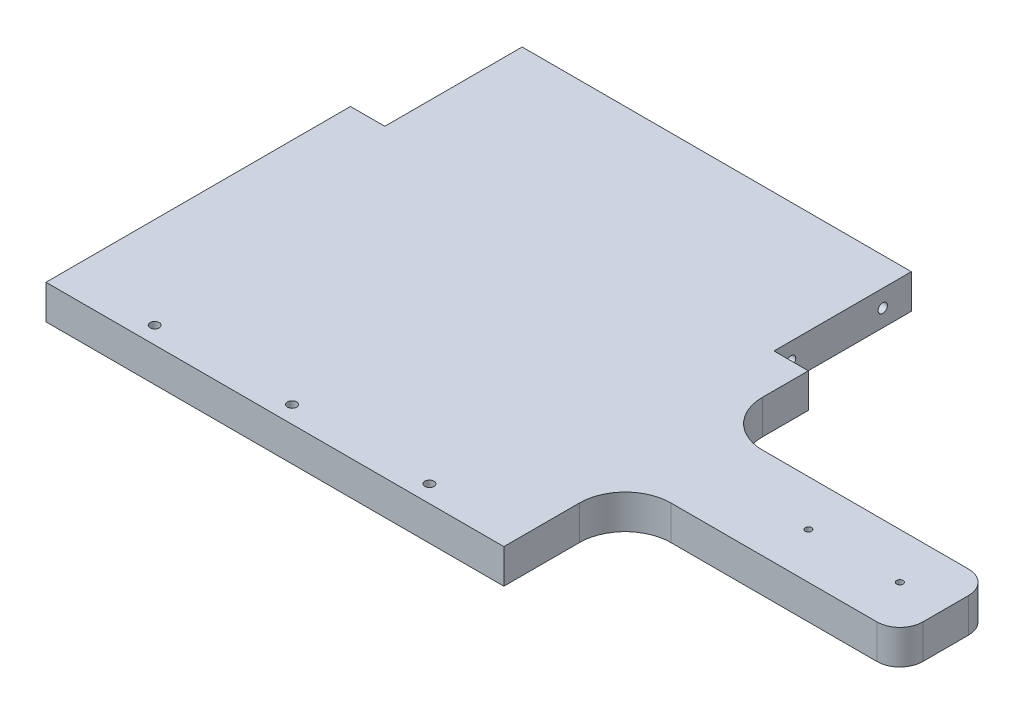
ISO-10303-21;
HEADER;
FILE_DESCRIPTION(('STEP AP214'),'2;1');
FILE_NAME('part.step','',(''),(''),'','','');
FILE_SCHEMA(('AUTOMOTIVE_DESIGN { 1 0 10303 214 1 1 1 1 }'));
ENDSEC;
DATA;
#1=APPLICATION_CONTEXT('core data for automotive mechanical design processes');
#2=APPLICATION_PROTOCOL_DEFINITION('international standard','automotive_design',2000,#1);
#3=PRODUCT_CONTEXT('',#1,'mechanical');
#4=PRODUCT('Part','Part','',(#3));
#5=PRODUCT_RELATED_PRODUCT_CATEGORY('part','',(#4));
#6=PRODUCT_DEFINITION_FORMATION('','',#4);
#7=PRODUCT_DEFINITION_CONTEXT('part definition',#1,'design');
#8=PRODUCT_DEFINITION('design','',#6,#7);
#9=PRODUCT_DEFINITION_SHAPE('','',#8);
#10=(LENGTH_UNIT() NAMED_UNIT(*) SI_UNIT(.MILLI.,.METRE.));
#11=(NAMED_UNIT(*) PLANE_ANGLE_UNIT() SI_UNIT($,.RADIAN.));
#12=(NAMED_UNIT(*) SI_UNIT($,.STERADIAN.) SOLID_ANGLE_UNIT());
#13=UNCERTAINTY_MEASURE_WITH_UNIT(LENGTH_MEASURE(1.E-05),#10,'distance_accuracy_value','');
#14=(GEOMETRIC_REPRESENTATION_CONTEXT(3) GLOBAL_UNCERTAINTY_ASSIGNED_CONTEXT((#13)) GLOBAL_UNIT_ASSIGNED_CONTEXT((#10,
#11,#12)) REPRESENTATION_CONTEXT('',''));
#15=CARTESIAN_POINT('',(0.,0.,0.));
#16=DIRECTION('',(0.,0.,1.));
#17=DIRECTION('',(1.,0.,0.));
#18=AXIS2_PLACEMENT_3D('',#15,#16,#17);
#19=CARTESIAN_POINT('',(107.95,9.525,-106.68));
#20=DIRECTION('',(1.,0.,0.));
#21=DIRECTION('',(0.,0.,-1.));
#22=AXIS2_PLACEMENT_3D('',#19,#20,#21);
#23=CYLINDRICAL_SURFACE('',#22,2.55269999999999);
#24=CARTESIAN_POINT('',(107.95,9.525,-106.68));
#25=DIRECTION('',(1.,0.,0.));
#26=DIRECTION('',(0.,0.,-1.));
#27=AXIS2_PLACEMENT_3D('',#24,#25,#26);
#28=CIRCLE('',#27,2.5527);
#29=CARTESIAN_POINT('',(107.95,9.525,-109.2327));
#30=VERTEX_POINT('',#29);
#31=EDGE_CURVE('E218',#30,#30,#28,.T.);
#32=ORIENTED_EDGE('',*,*,#31,.T.);
#33=EDGE_LOOP('',(#32));
#34=FACE_BOUND('',#33,.T.);
#35=CARTESIAN_POINT('',(63.5,9.525,-106.68));
#36=DIRECTION('',(0.707106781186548,0.,0.707106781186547));
#37=DIRECTION('',(0.707106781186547,0.,-0.707106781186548));
#38=AXIS2_PLACEMENT_3D('',#35,#36,#37);
#39=ELLIPSE('',#38,3.61006296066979,2.55269999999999);
#40=CARTESIAN_POINT('',(63.5,12.0777,-106.68));
#41=VERTEX_POINT('',#40);
#42=CARTESIAN_POINT('',(63.5,6.97230000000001,-106.68));
#43=VERTEX_POINT('',#42);
#44=EDGE_CURVE('E47',#41,#43,#39,.F.);
#45=ORIENTED_EDGE('',*,*,#44,.T.);
#46=CARTESIAN_POINT('',(63.5,9.525,-106.68));
#47=DIRECTION('',(0.707106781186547,0.,-0.707106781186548));
#48=DIRECTION('',(0.707106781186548,0.,0.707106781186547));
#49=AXIS2_PLACEMENT_3D('',#46,#47,#48);
#50=ELLIPSE('',#49,3.61006296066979,2.55269999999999);
#51=EDGE_CURVE('E11',#43,#41,#50,.F.);
#52=ORIENTED_EDGE('',*,*,#51,.T.);
#53=EDGE_LOOP('',(#45,#52));
#54=FACE_BOUND('',#53,.T.);
#55=ADVANCED_FACE('F34',(#34,#54),#23,.F.);
#56=CARTESIAN_POINT('',(-107.95,9.525,-106.68));
#57=DIRECTION('',(-1.,0.,0.));
#58=DIRECTION('',(0.,0.,1.));
#59=AXIS2_PLACEMENT_3D('',#56,#57,#58);
#60=CYLINDRICAL_SURFACE('',#59,2.55269999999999);
#61=CARTESIAN_POINT('',(-107.95,9.525,-106.68));
#62=DIRECTION('',(-1.,0.,0.));
#63=DIRECTION('',(0.,0.,1.));
#64=AXIS2_PLACEMENT_3D('',#61,#62,#63);
#65=CIRCLE('',#64,2.5527);
#66=CARTESIAN_POINT('',(-107.95,9.525,-104.1273));
#67=VERTEX_POINT('',#66);
#68=EDGE_CURVE('E206',#67,#67,#65,.T.);
#69=ORIENTED_EDGE('',*,*,#68,.T.);
#70=EDGE_LOOP('',(#69));
#71=FACE_BOUND('',#70,.T.);
#72=CARTESIAN_POINT('',(-63.5,9.525,-106.68));
#73=DIRECTION('',(-0.707106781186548,0.,0.707106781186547));
#74=DIRECTION('',(-0.707106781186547,0.,-0.707106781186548));
#75=AXIS2_PLACEMENT_3D('',#72,#73,#74);
#76=ELLIPSE('',#75,3.61006296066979,2.55269999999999);
#77=CARTESIAN_POINT('',(-63.5,6.97230000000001,-106.68));
#78=VERTEX_POINT('',#77);
#79=CARTESIAN_POINT('',(-63.5,12.0777,-106.68));
#80=VERTEX_POINT('',#79);
#81=EDGE_CURVE('E54',#78,#80,#76,.F.);
#82=ORIENTED_EDGE('',*,*,#81,.T.);
#83=CARTESIAN_POINT('',(-63.5,9.525,-106.68));
#84=DIRECTION('',(-0.707106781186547,0.,-0.707106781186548));
#85=DIRECTION('',(-0.707106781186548,0.,0.707106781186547));
#86=AXIS2_PLACEMENT_3D('',#83,#84,#85);
#87=ELLIPSE('',#86,3.61006296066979,2.55269999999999);
#88=EDGE_CURVE('E384',#80,#78,#87,.F.);
#89=ORIENTED_EDGE('',*,*,#88,.T.);
#90=EDGE_LOOP('',(#82,#89));
#91=FACE_BOUND('',#90,.T.);
#92=ADVANCED_FACE('F399',(#71,#91),#60,.F.);
#93=CARTESIAN_POINT('',(0.,19.05,-122.555));
#94=DIRECTION('',(0.,0.,1.));
#95=DIRECTION('',(1.,0.,0.));
#96=AXIS2_PLACEMENT_3D('',#93,#94,#95);
#97=PLANE('',#96);
#98=CARTESIAN_POINT('',(0.,9.52500000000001,-122.555));
#99=DIRECTION('',(0.,0.,-1.));
#100=DIRECTION('',(-1.,0.,0.));
#101=AXIS2_PLACEMENT_3D('',#98,#99,#100);
#102=CIRCLE('',#101,2.5527);
#103=CARTESIAN_POINT('',(-2.55270000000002,9.52500000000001,-122.555));
#104=VERTEX_POINT('',#103);
#105=EDGE_CURVE('E190',#104,#104,#102,.T.);
#106=ORIENTED_EDGE('',*,*,#105,.F.);
#107=EDGE_LOOP('',(#106));
#108=FACE_BOUND('',#107,.T.);
#109=CARTESIAN_POINT('',(63.5,9.525,-122.555));
#110=DIRECTION('',(0.,0.,-1.));
#111=DIRECTION('',(-1.,0.,0.));
#112=AXIS2_PLACEMENT_3D('',#109,#110,#111);
#113=CIRCLE('',#112,2.55269999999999);
#114=CARTESIAN_POINT('',(60.9473,9.525,-122.555));
#115=VERTEX_POINT('',#114);
#116=EDGE_CURVE('E189',#115,#115,#113,.T.);
#117=ORIENTED_EDGE('',*,*,#116,.F.);
#118=EDGE_LOOP('',(#117));
#119=FACE_BOUND('',#118,.T.);
#120=CARTESIAN_POINT('',(-63.5,9.525,-122.555));
#121=DIRECTION('',(0.,0.,-1.));
#122=DIRECTION('',(-1.,0.,0.));
#123=AXIS2_PLACEMENT_3D('',#120,#121,#122);
#124=CIRCLE('',#123,2.5527);
#125=CARTESIAN_POINT('',(-66.0527,9.525,-122.555));
#126=VERTEX_POINT('',#125);
#127=EDGE_CURVE('E200',#126,#126,#124,.T.);
#128=ORIENTED_EDGE('',*,*,#127,.F.);
#129=EDGE_LOOP('',(#128));
#130=FACE_BOUND('',#129,.T.);
#131=DIRECTION('',(0.,1.,0.));
#132=VECTOR('',#131,1.);
#133=CARTESIAN_POINT('',(107.95,19.05,-122.555));
#134=LINE('',#133,#132);
#135=CARTESIAN_POINT('',(107.95,0.,-122.555));
#136=VERTEX_POINT('',#135);
#137=CARTESIAN_POINT('',(107.95,19.05,-122.555));
#138=VERTEX_POINT('',#137);
#139=EDGE_CURVE('E238',#136,#138,#134,.T.);
#140=ORIENTED_EDGE('',*,*,#139,.F.);
#141=DIRECTION('',(-1.,0.,0.));
#142=VECTOR('',#141,1.);
#143=CARTESIAN_POINT('',(0.,0.,-122.555));
#144=LINE('',#143,#142);
#145=CARTESIAN_POINT('',(-107.95,0.,-122.555));
#146=VERTEX_POINT('',#145);
#147=EDGE_CURVE('E331',#136,#146,#144,.T.);
#148=ORIENTED_EDGE('',*,*,#147,.T.);
#149=DIRECTION('',(0.,-1.,0.));
#150=VECTOR('',#149,1.);
#151=CARTESIAN_POINT('',(-107.95,0.,-122.555));
#152=LINE('',#151,#150);
#153=CARTESIAN_POINT('',(-107.95,19.05,-122.555));
#154=VERTEX_POINT('',#153);
#155=EDGE_CURVE('E274',#154,#146,#152,.T.);
#156=ORIENTED_EDGE('',*,*,#155,.F.);
#157=DIRECTION('',(-1.,0.,0.));
#158=VECTOR('',#157,1.);
#159=CARTESIAN_POINT('',(0.,19.05,-122.555));
#160=LINE('',#159,#158);
#161=EDGE_CURVE('E310',#138,#154,#160,.T.);
#162=ORIENTED_EDGE('',*,*,#161,.F.);
#163=EDGE_LOOP('',(#140,#148,#156,#162));
#164=FACE_BOUND('',#163,.T.);
#165=ADVANCED_FACE('F405',(#108,#119,#130,#164),#97,.F.);
#166=CARTESIAN_POINT('',(127.,19.05,0.));
#167=DIRECTION('',(-1.,0.,0.));
#168=DIRECTION('',(0.,0.,1.));
#169=AXIS2_PLACEMENT_3D('',#166,#167,#168);
#170=PLANE('',#169);
#171=DIRECTION('',(0.,0.,-1.));
#172=VECTOR('',#171,1.);
#173=CARTESIAN_POINT('',(127.,0.,0.));
#174=LINE('',#173,#172);
#175=CARTESIAN_POINT('',(127.,0.,122.555));
#176=VERTEX_POINT('',#175);
#177=CARTESIAN_POINT('',(127.,0.,80.645));
#178=VERTEX_POINT('',#177);
#179=EDGE_CURVE('E293',#176,#178,#174,.T.);
#180=ORIENTED_EDGE('',*,*,#179,.T.);
#181=DIRECTION('',(0.,-1.,0.));
#182=VECTOR('',#181,1.);
#183=CARTESIAN_POINT('',(127.,19.05,80.645));
#184=LINE('',#183,#182);
#185=CARTESIAN_POINT('',(127.,19.05,80.645));
#186=VERTEX_POINT('',#185);
#187=EDGE_CURVE('E353',#178,#186,#184,.F.);
#188=ORIENTED_EDGE('',*,*,#187,.T.);
#189=DIRECTION('',(0.,0.,-1.));
#190=VECTOR('',#189,1.);
#191=CARTESIAN_POINT('',(127.,19.05,0.));
#192=LINE('',#191,#190);
#193=CARTESIAN_POINT('',(127.,19.05,122.555));
#194=VERTEX_POINT('',#193);
#195=EDGE_CURVE('E296',#194,#186,#192,.T.);
#196=ORIENTED_EDGE('',*,*,#195,.F.);
#197=DIRECTION('',(0.,-1.,0.));
#198=VECTOR('',#197,1.);
#199=CARTESIAN_POINT('',(127.,19.05,122.555));
#200=LINE('',#199,#198);
#201=EDGE_CURVE('E318',#194,#176,#200,.T.);
#202=ORIENTED_EDGE('',*,*,#201,.T.);
#203=EDGE_LOOP('',(#180,#188,#196,#202));
#204=FACE_BOUND('',#203,.T.);
#205=ADVANCED_FACE('F492',(#204),#170,.F.);
#206=CARTESIAN_POINT('',(0.,19.05,55.245));
#207=DIRECTION('',(0.,0.,-1.));
#208=DIRECTION('',(-1.,0.,0.));
#209=AXIS2_PLACEMENT_3D('',#206,#207,#208);
#210=PLANE('',#209);
#211=DIRECTION('',(1.,0.,0.));
#212=VECTOR('',#211,1.);
#213=CARTESIAN_POINT('',(0.,0.,55.245));
#214=LINE('',#213,#212);
#215=CARTESIAN_POINT('',(152.4,0.,55.245));
#216=VERTEX_POINT('',#215);
#217=CARTESIAN_POINT('',(266.7,0.,55.245));
#218=VERTEX_POINT('',#217);
#219=EDGE_CURVE('E321',#216,#218,#214,.T.);
#220=ORIENTED_EDGE('',*,*,#219,.T.);
#221=DIRECTION('',(0.,-1.,0.));
#222=VECTOR('',#221,1.);
#223=CARTESIAN_POINT('',(266.7,19.05,55.245));
#224=LINE('',#223,#222);
#225=CARTESIAN_POINT('',(266.7,19.05,55.245));
#226=VERTEX_POINT('',#225);
#227=EDGE_CURVE('E373',#218,#226,#224,.F.);
#228=ORIENTED_EDGE('',*,*,#227,.T.);
#229=DIRECTION('',(1.,0.,0.));
#230=VECTOR('',#229,1.);
#231=CARTESIAN_POINT('',(0.,19.05,55.245));
#232=LINE('',#231,#230);
#233=CARTESIAN_POINT('',(152.4,19.05,55.245));
#234=VERTEX_POINT('',#233);
#235=EDGE_CURVE('E299',#234,#226,#232,.T.);
#236=ORIENTED_EDGE('',*,*,#235,.F.);
#237=DIRECTION('',(0.,-1.,0.));
#238=VECTOR('',#237,1.);
#239=CARTESIAN_POINT('',(152.4,0.,55.245));
#240=LINE('',#239,#238);
#241=EDGE_CURVE('E350',#234,#216,#240,.T.);
#242=ORIENTED_EDGE('',*,*,#241,.T.);
#243=EDGE_LOOP('',(#220,#228,#236,#242));
#244=FACE_BOUND('',#243,.T.);
#245=ADVANCED_FACE('F504',(#244),#210,.F.);
#246=CARTESIAN_POINT('',(279.4,19.05,0.));
#247=DIRECTION('',(1.,0.,0.));
#248=DIRECTION('',(0.,0.,-1.));
#249=AXIS2_PLACEMENT_3D('',#246,#247,#248);
#250=PLANE('',#249);
#251=DIRECTION('',(0.,0.,1.));
#252=VECTOR('',#251,1.);
#253=CARTESIAN_POINT('',(279.4,19.05,0.));
#254=LINE('',#253,#252);
#255=CARTESIAN_POINT('',(279.4,19.05,17.145));
#256=VERTEX_POINT('',#255);
#257=CARTESIAN_POINT('',(279.4,19.05,42.545));
#258=VERTEX_POINT('',#257);
#259=EDGE_CURVE('E304',#256,#258,#254,.T.);
#260=ORIENTED_EDGE('',*,*,#259,.T.);
#261=DIRECTION('',(0.,-1.,0.));
#262=VECTOR('',#261,1.);
#263=CARTESIAN_POINT('',(279.4,0.,42.545));
#264=LINE('',#263,#262);
#265=CARTESIAN_POINT('',(279.4,0.,42.545));
#266=VERTEX_POINT('',#265);
#267=EDGE_CURVE('E368',#258,#266,#264,.T.);
#268=ORIENTED_EDGE('',*,*,#267,.T.);
#269=DIRECTION('',(0.,0.,1.));
#270=VECTOR('',#269,1.);
#271=CARTESIAN_POINT('',(279.4,0.,0.));
#272=LINE('',#271,#270);
#273=CARTESIAN_POINT('',(279.4,0.,17.145));
#274=VERTEX_POINT('',#273);
#275=EDGE_CURVE('E325',#274,#266,#272,.T.);
#276=ORIENTED_EDGE('',*,*,#275,.F.);
#277=DIRECTION('',(0.,-1.,0.));
#278=VECTOR('',#277,1.);
#279=CARTESIAN_POINT('',(279.4,19.05,17.145));
#280=LINE('',#279,#278);
#281=EDGE_CURVE('E364',#274,#256,#280,.F.);
#282=ORIENTED_EDGE('',*,*,#281,.T.);
#283=EDGE_LOOP('',(#260,#268,#276,#282));
#284=FACE_BOUND('',#283,.T.);
#285=ADVANCED_FACE('F500',(#284),#250,.T.);
#286=CARTESIAN_POINT('',(0.,19.05,4.44500000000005));
#287=DIRECTION('',(0.,0.,-1.));
#288=DIRECTION('',(-1.,0.,0.));
#289=AXIS2_PLACEMENT_3D('',#286,#287,#288);
#290=PLANE('',#289);
#291=DIRECTION('',(1.,0.,0.));
#292=VECTOR('',#291,1.);
#293=CARTESIAN_POINT('',(0.,19.05,4.44500000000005));
#294=LINE('',#293,#292);
#295=CARTESIAN_POINT('',(152.4,19.05,4.445));
#296=VERTEX_POINT('',#295);
#297=CARTESIAN_POINT('',(266.7,19.05,4.44499999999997));
#298=VERTEX_POINT('',#297);
#299=EDGE_CURVE('E307',#296,#298,#294,.T.);
#300=ORIENTED_EDGE('',*,*,#299,.T.);
#301=DIRECTION('',(0.,-1.,0.));
#302=VECTOR('',#301,1.);
#303=CARTESIAN_POINT('',(266.7,19.05,4.44499999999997));
#304=LINE('',#303,#302);
#305=CARTESIAN_POINT('',(266.7,0.,4.44499999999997));
#306=VERTEX_POINT('',#305);
#307=EDGE_CURVE('E359',#298,#306,#304,.T.);
#308=ORIENTED_EDGE('',*,*,#307,.T.);
#309=DIRECTION('',(1.,0.,0.));
#310=VECTOR('',#309,1.);
#311=CARTESIAN_POINT('',(0.,0.,4.44500000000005));
#312=LINE('',#311,#310);
#313=CARTESIAN_POINT('',(152.4,0.,4.445));
#314=VERTEX_POINT('',#313);
#315=EDGE_CURVE('E328',#314,#306,#312,.T.);
#316=ORIENTED_EDGE('',*,*,#315,.F.);
#317=DIRECTION('',(0.,-1.,0.));
#318=VECTOR('',#317,1.);
#319=CARTESIAN_POINT('',(152.4,19.05,4.445));
#320=LINE('',#319,#318);
#321=EDGE_CURVE('E344',#314,#296,#320,.F.);
#322=ORIENTED_EDGE('',*,*,#321,.T.);
#323=EDGE_LOOP('',(#300,#308,#316,#322));
#324=FACE_BOUND('',#323,.T.);
#325=ADVANCED_FACE('F496',(#324),#290,.T.);
#326=CARTESIAN_POINT('',(127.,0.,-20.955));
#327=VERTEX_POINT('',#326);
#328=CARTESIAN_POINT('',(127.,0.,-46.355));
#329=VERTEX_POINT('',#328);
#330=EDGE_CURVE('E322',#327,#329,#174,.T.);
#331=ORIENTED_EDGE('',*,*,#330,.T.);
#332=DIRECTION('',(0.,-1.,0.));
#333=VECTOR('',#332,1.);
#334=CARTESIAN_POINT('',(127.,19.05,-46.355));
#335=LINE('',#334,#333);
#336=CARTESIAN_POINT('',(127.,19.05,-46.355));
#337=VERTEX_POINT('',#336);
#338=EDGE_CURVE('E230',#337,#329,#335,.T.);
#339=ORIENTED_EDGE('',*,*,#338,.F.);
#340=CARTESIAN_POINT('',(127.,19.05,-20.955));
#341=VERTEX_POINT('',#340);
#342=EDGE_CURVE('E301',#341,#337,#192,.T.);
#343=ORIENTED_EDGE('',*,*,#342,.F.);
#344=DIRECTION('',(0.,-1.,0.));
#345=VECTOR('',#344,1.);
#346=CARTESIAN_POINT('',(127.,19.05,-20.955));
#347=LINE('',#346,#345);
#348=EDGE_CURVE('E341',#341,#327,#347,.T.);
#349=ORIENTED_EDGE('',*,*,#348,.T.);
#350=EDGE_LOOP('',(#331,#339,#343,#349));
#351=FACE_BOUND('',#350,.T.);
#352=ADVANCED_FACE('F488',(#351),#170,.F.);
#353=CARTESIAN_POINT('',(-127.,19.05,0.));
#354=DIRECTION('',(-1.,0.,0.));
#355=DIRECTION('',(0.,0.,1.));
#356=AXIS2_PLACEMENT_3D('',#353,#354,#355);
#357=PLANE('',#356);
#358=DIRECTION('',(0.,1.,0.));
#359=VECTOR('',#358,1.);
#360=CARTESIAN_POINT('',(-127.,0.,-46.355));
#361=LINE('',#360,#359);
#362=CARTESIAN_POINT('',(-127.,0.,-46.355));
#363=VERTEX_POINT('',#362);
#364=CARTESIAN_POINT('',(-127.,19.05,-46.355));
#365=VERTEX_POINT('',#364);
#366=EDGE_CURVE('E264',#363,#365,#361,.T.);
#367=ORIENTED_EDGE('',*,*,#366,.F.);
#368=DIRECTION('',(0.,0.,-1.));
#369=VECTOR('',#368,1.);
#370=CARTESIAN_POINT('',(-127.,0.,0.));
#371=LINE('',#370,#369);
#372=CARTESIAN_POINT('',(-127.,0.,122.555));
#373=VERTEX_POINT('',#372);
#374=EDGE_CURVE('E333',#373,#363,#371,.T.);
#375=ORIENTED_EDGE('',*,*,#374,.F.);
#376=DIRECTION('',(0.,-1.,0.));
#377=VECTOR('',#376,1.);
#378=CARTESIAN_POINT('',(-127.,19.05,122.555));
#379=LINE('',#378,#377);
#380=CARTESIAN_POINT('',(-127.,19.05,122.555));
#381=VERTEX_POINT('',#380);
#382=EDGE_CURVE('E339',#381,#373,#379,.T.);
#383=ORIENTED_EDGE('',*,*,#382,.F.);
#384=DIRECTION('',(0.,0.,-1.));
#385=VECTOR('',#384,1.);
#386=CARTESIAN_POINT('',(-127.,19.05,0.));
#387=LINE('',#386,#385);
#388=EDGE_CURVE('E312',#381,#365,#387,.T.);
#389=ORIENTED_EDGE('',*,*,#388,.T.);
#390=EDGE_LOOP('',(#367,#375,#383,#389));
#391=FACE_BOUND('',#390,.T.);
#392=ADVANCED_FACE('F484',(#391),#357,.T.);
#393=CARTESIAN_POINT('',(0.,19.05,122.555));
#394=DIRECTION('',(0.,0.,1.));
#395=DIRECTION('',(1.,0.,0.));
#396=AXIS2_PLACEMENT_3D('',#393,#394,#395);
#397=PLANE('',#396);
#398=DIRECTION('',(-1.,0.,0.));
#399=VECTOR('',#398,1.);
#400=CARTESIAN_POINT('',(0.,0.,122.555));
#401=LINE('',#400,#399);
#402=EDGE_CURVE('E300',#176,#373,#401,.T.);
#403=ORIENTED_EDGE('',*,*,#402,.F.);
#404=ORIENTED_EDGE('',*,*,#201,.F.);
#405=DIRECTION('',(-1.,0.,0.));
#406=VECTOR('',#405,1.);
#407=CARTESIAN_POINT('',(0.,19.05,122.555));
#408=LINE('',#407,#406);
#409=EDGE_CURVE('E315',#194,#381,#408,.T.);
#410=ORIENTED_EDGE('',*,*,#409,.T.);
#411=ORIENTED_EDGE('',*,*,#382,.T.);
#412=EDGE_LOOP('',(#403,#404,#410,#411));
#413=FACE_BOUND('',#412,.T.);
#414=ADVANCED_FACE('F477',(#413),#397,.T.);
#415=CARTESIAN_POINT('',(0.,19.05,0.));
#416=DIRECTION('',(0.,1.,0.));
#417=DIRECTION('',(0.,0.,1.));
#418=AXIS2_PLACEMENT_3D('',#415,#416,#417);
#419=PLANE('',#418);
#420=DIRECTION('',(1.,0.,0.));
#421=VECTOR('',#420,1.);
#422=CARTESIAN_POINT('',(107.95,19.05,-46.355));
#423=LINE('',#422,#421);
#424=CARTESIAN_POINT('',(107.95,19.05,-46.355));
#425=VERTEX_POINT('',#424);
#426=EDGE_CURVE('E240',#425,#337,#423,.T.);
#427=ORIENTED_EDGE('',*,*,#426,.F.);
#428=DIRECTION('',(0.,0.,1.));
#429=VECTOR('',#428,1.);
#430=CARTESIAN_POINT('',(107.95,19.05,-122.555));
#431=LINE('',#430,#429);
#432=EDGE_CURVE('E231',#138,#425,#431,.T.);
#433=ORIENTED_EDGE('',*,*,#432,.F.);
#434=ORIENTED_EDGE('',*,*,#161,.T.);
#435=DIRECTION('',(0.,0.,-1.));
#436=VECTOR('',#435,1.);
#437=CARTESIAN_POINT('',(-107.95,19.05,-122.555));
#438=LINE('',#437,#436);
#439=CARTESIAN_POINT('',(-107.95,19.05,-46.355));
#440=VERTEX_POINT('',#439);
#441=EDGE_CURVE('E271',#440,#154,#438,.T.);
#442=ORIENTED_EDGE('',*,*,#441,.F.);
#443=DIRECTION('',(-1.,0.,0.));
#444=VECTOR('',#443,1.);
#445=CARTESIAN_POINT('',(-107.95,19.05,-46.355));
#446=LINE('',#445,#444);
#447=EDGE_CURVE('E279',#440,#365,#446,.T.);
#448=ORIENTED_EDGE('',*,*,#447,.T.);
#449=ORIENTED_EDGE('',*,*,#388,.F.);
#450=ORIENTED_EDGE('',*,*,#409,.F.);
#451=ORIENTED_EDGE('',*,*,#195,.T.);
#452=CARTESIAN_POINT('',(152.4,19.05,80.645));
#453=DIRECTION('',(0.,1.,0.));
#454=DIRECTION('',(0.,0.,1.));
#455=AXIS2_PLACEMENT_3D('',#452,#453,#454);
#456=CIRCLE('',#455,25.4);
#457=EDGE_CURVE('E357',#186,#234,#456,.F.);
#458=ORIENTED_EDGE('',*,*,#457,.T.);
#459=ORIENTED_EDGE('',*,*,#235,.T.);
#460=CARTESIAN_POINT('',(266.7,19.05,42.545));
#461=DIRECTION('',(0.,1.,0.));
#462=DIRECTION('',(0.,0.,1.));
#463=AXIS2_PLACEMENT_3D('',#460,#461,#462);
#464=CIRCLE('',#463,12.7);
#465=EDGE_CURVE('E375',#226,#258,#464,.T.);
#466=ORIENTED_EDGE('',*,*,#465,.T.);
#467=ORIENTED_EDGE('',*,*,#259,.F.);
#468=CARTESIAN_POINT('',(266.7,19.05,17.145));
#469=DIRECTION('',(0.,1.,0.));
#470=DIRECTION('',(0.,0.,1.));
#471=AXIS2_PLACEMENT_3D('',#468,#469,#470);
#472=CIRCLE('',#471,12.7);
#473=EDGE_CURVE('E366',#256,#298,#472,.T.);
#474=ORIENTED_EDGE('',*,*,#473,.T.);
#475=ORIENTED_EDGE('',*,*,#299,.F.);
#476=CARTESIAN_POINT('',(152.4,19.05,-20.955));
#477=DIRECTION('',(0.,1.,0.));
#478=DIRECTION('',(0.,0.,1.));
#479=AXIS2_PLACEMENT_3D('',#476,#477,#478);
#480=CIRCLE('',#479,25.4);
#481=EDGE_CURVE('E348',#296,#341,#480,.F.);
#482=ORIENTED_EDGE('',*,*,#481,.T.);
#483=ORIENTED_EDGE('',*,*,#342,.T.);
#484=EDGE_LOOP('',(#427,#433,#434,#442,#448,#449,#450,#451,#458,#459,#466,#467,#474,#475,#482,#483));
#485=FACE_BOUND('',#484,.T.);
#486=CARTESIAN_POINT('',(0.,19.05,113.03));
#487=DIRECTION('',(0.,1.,0.));
#488=DIRECTION('',(0.,0.,1.));
#489=AXIS2_PLACEMENT_3D('',#486,#487,#488);
#490=CIRCLE('',#489,2.5527);
#491=CARTESIAN_POINT('',(0.,19.05,115.5827));
#492=VERTEX_POINT('',#491);
#493=EDGE_CURVE('E245',#492,#492,#490,.T.);
#494=ORIENTED_EDGE('',*,*,#493,.F.);
#495=EDGE_LOOP('',(#494));
#496=FACE_BOUND('',#495,.T.);
#497=CARTESIAN_POINT('',(76.2,19.05,113.03));
#498=DIRECTION('',(0.,1.,0.));
#499=DIRECTION('',(0.,0.,1.));
#500=AXIS2_PLACEMENT_3D('',#497,#498,#499);
#501=CIRCLE('',#500,2.55269999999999);
#502=CARTESIAN_POINT('',(76.2,19.05,115.5827));
#503=VERTEX_POINT('',#502);
#504=EDGE_CURVE('E252',#503,#503,#501,.T.);
#505=ORIENTED_EDGE('',*,*,#504,.F.);
#506=EDGE_LOOP('',(#505));
#507=FACE_BOUND('',#506,.T.);
#508=CARTESIAN_POINT('',(-76.2,19.05,113.03));
#509=DIRECTION('',(0.,1.,0.));
#510=DIRECTION('',(0.,0.,1.));
#511=AXIS2_PLACEMENT_3D('',#508,#509,#510);
#512=CIRCLE('',#511,2.55269999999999);
#513=CARTESIAN_POINT('',(-76.2,19.05,115.5827));
#514=VERTEX_POINT('',#513);
#515=EDGE_CURVE('E258',#514,#514,#512,.T.);
#516=ORIENTED_EDGE('',*,*,#515,.F.);
#517=EDGE_LOOP('',(#516));
#518=FACE_BOUND('',#517,.T.);
#519=CARTESIAN_POINT('',(254.,19.05,29.845));
#520=DIRECTION('',(0.,1.,0.));
#521=DIRECTION('',(0.,0.,1.));
#522=AXIS2_PLACEMENT_3D('',#519,#520,#521);
#523=CIRCLE('',#522,1.77799999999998);
#524=CARTESIAN_POINT('',(254.,19.05,31.623));
#525=VERTEX_POINT('',#524);
#526=EDGE_CURVE('E282',#525,#525,#523,.T.);
#527=ORIENTED_EDGE('',*,*,#526,.F.);
#528=EDGE_LOOP('',(#527));
#529=FACE_BOUND('',#528,.T.);
#530=CARTESIAN_POINT('',(203.2,19.05,29.845));
#531=DIRECTION('',(0.,1.,0.));
#532=DIRECTION('',(0.,0.,1.));
#533=AXIS2_PLACEMENT_3D('',#530,#531,#532);
#534=CIRCLE('',#533,1.77800000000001);
#535=CARTESIAN_POINT('',(203.2,19.05,31.623));
#536=VERTEX_POINT('',#535);
#537=EDGE_CURVE('E287',#536,#536,#534,.T.);
#538=ORIENTED_EDGE('',*,*,#537,.F.);
#539=EDGE_LOOP('',(#538));
#540=FACE_BOUND('',#539,.T.);
#541=ADVANCED_FACE('F474',(#485,#496,#507,#518,#529,#540),#419,.T.);
#542=CARTESIAN_POINT('',(0.,0.,0.));
#543=DIRECTION('',(0.,1.,0.));
#544=DIRECTION('',(0.,0.,1.));
#545=AXIS2_PLACEMENT_3D('',#542,#543,#544);
#546=PLANE('',#545);
#547=CARTESIAN_POINT('',(0.,0.,113.03));
#548=DIRECTION('',(0.,1.,0.));
#549=DIRECTION('',(0.,0.,1.));
#550=AXIS2_PLACEMENT_3D('',#547,#548,#549);
#551=CIRCLE('',#550,2.5527);
#552=CARTESIAN_POINT('',(0.,0.,115.5827));
#553=VERTEX_POINT('',#552);
#554=EDGE_CURVE('E249',#553,#553,#551,.T.);
#555=ORIENTED_EDGE('',*,*,#554,.T.);
#556=EDGE_LOOP('',(#555));
#557=FACE_BOUND('',#556,.T.);
#558=CARTESIAN_POINT('',(76.2,0.,113.03));
#559=DIRECTION('',(0.,1.,0.));
#560=DIRECTION('',(0.,0.,1.));
#561=AXIS2_PLACEMENT_3D('',#558,#559,#560);
#562=CIRCLE('',#561,2.55269999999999);
#563=CARTESIAN_POINT('',(76.2,0.,115.5827));
#564=VERTEX_POINT('',#563);
#565=EDGE_CURVE('E255',#564,#564,#562,.T.);
#566=ORIENTED_EDGE('',*,*,#565,.T.);
#567=EDGE_LOOP('',(#566));
#568=FACE_BOUND('',#567,.T.);
#569=CARTESIAN_POINT('',(-76.2,0.,113.03));
#570=DIRECTION('',(0.,1.,0.));
#571=DIRECTION('',(0.,0.,1.));
#572=AXIS2_PLACEMENT_3D('',#569,#570,#571);
#573=CIRCLE('',#572,2.55269999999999);
#574=CARTESIAN_POINT('',(-76.2,0.,115.5827));
#575=VERTEX_POINT('',#574);
#576=EDGE_CURVE('E261',#575,#575,#573,.T.);
#577=ORIENTED_EDGE('',*,*,#576,.T.);
#578=EDGE_LOOP('',(#577));
#579=FACE_BOUND('',#578,.T.);
#580=CARTESIAN_POINT('',(254.,0.,29.845));
#581=DIRECTION('',(0.,1.,0.));
#582=DIRECTION('',(0.,0.,1.));
#583=AXIS2_PLACEMENT_3D('',#580,#581,#582);
#584=CIRCLE('',#583,1.77799999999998);
#585=CARTESIAN_POINT('',(254.,0.,31.623));
#586=VERTEX_POINT('',#585);
#587=EDGE_CURVE('E284',#586,#586,#584,.T.);
#588=ORIENTED_EDGE('',*,*,#587,.T.);
#589=EDGE_LOOP('',(#588));
#590=FACE_BOUND('',#589,.T.);
#591=CARTESIAN_POINT('',(203.2,0.,29.845));
#592=DIRECTION('',(0.,1.,0.));
#593=DIRECTION('',(0.,0.,1.));
#594=AXIS2_PLACEMENT_3D('',#591,#592,#593);
#595=CIRCLE('',#594,1.77800000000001);
#596=CARTESIAN_POINT('',(203.2,0.,31.623));
#597=VERTEX_POINT('',#596);
#598=EDGE_CURVE('E290',#597,#597,#595,.T.);
#599=ORIENTED_EDGE('',*,*,#598,.T.);
#600=EDGE_LOOP('',(#599));
#601=FACE_BOUND('',#600,.T.);
#602=DIRECTION('',(0.,0.,-1.));
#603=VECTOR('',#602,1.);
#604=CARTESIAN_POINT('',(107.95,0.,-122.555));
#605=LINE('',#604,#603);
#606=CARTESIAN_POINT('',(107.95,0.,-46.355));
#607=VERTEX_POINT('',#606);
#608=EDGE_CURVE('E236',#607,#136,#605,.T.);
#609=ORIENTED_EDGE('',*,*,#608,.F.);
#610=DIRECTION('',(1.,0.,0.));
#611=VECTOR('',#610,1.);
#612=CARTESIAN_POINT('',(107.95,0.,-46.355));
#613=LINE('',#612,#611);
#614=EDGE_CURVE('E242',#607,#329,#613,.T.);
#615=ORIENTED_EDGE('',*,*,#614,.T.);
#616=ORIENTED_EDGE('',*,*,#330,.F.);
#617=CARTESIAN_POINT('',(152.4,0.,-20.955));
#618=DIRECTION('',(0.,1.,0.));
#619=DIRECTION('',(0.,0.,1.));
#620=AXIS2_PLACEMENT_3D('',#617,#618,#619);
#621=CIRCLE('',#620,25.4);
#622=EDGE_CURVE('E346',#327,#314,#621,.T.);
#623=ORIENTED_EDGE('',*,*,#622,.T.);
#624=ORIENTED_EDGE('',*,*,#315,.T.);
#625=CARTESIAN_POINT('',(266.7,0.,17.145));
#626=DIRECTION('',(0.,1.,0.));
#627=DIRECTION('',(0.,0.,1.));
#628=AXIS2_PLACEMENT_3D('',#625,#626,#627);
#629=CIRCLE('',#628,12.7);
#630=EDGE_CURVE('E362',#306,#274,#629,.F.);
#631=ORIENTED_EDGE('',*,*,#630,.T.);
#632=ORIENTED_EDGE('',*,*,#275,.T.);
#633=CARTESIAN_POINT('',(266.7,0.,42.545));
#634=DIRECTION('',(0.,1.,0.));
#635=DIRECTION('',(0.,0.,1.));
#636=AXIS2_PLACEMENT_3D('',#633,#634,#635);
#637=CIRCLE('',#636,12.7);
#638=EDGE_CURVE('E371',#266,#218,#637,.F.);
#639=ORIENTED_EDGE('',*,*,#638,.T.);
#640=ORIENTED_EDGE('',*,*,#219,.F.);
#641=CARTESIAN_POINT('',(152.4,0.,80.645));
#642=DIRECTION('',(0.,1.,0.));
#643=DIRECTION('',(0.,0.,1.));
#644=AXIS2_PLACEMENT_3D('',#641,#642,#643);
#645=CIRCLE('',#644,25.4);
#646=EDGE_CURVE('E355',#216,#178,#645,.T.);
#647=ORIENTED_EDGE('',*,*,#646,.T.);
#648=ORIENTED_EDGE('',*,*,#179,.F.);
#649=ORIENTED_EDGE('',*,*,#402,.T.);
#650=ORIENTED_EDGE('',*,*,#374,.T.);
#651=DIRECTION('',(-1.,0.,0.));
#652=VECTOR('',#651,1.);
#653=CARTESIAN_POINT('',(-107.95,0.,-46.355));
#654=LINE('',#653,#652);
#655=CARTESIAN_POINT('',(-107.95,0.,-46.355));
#656=VERTEX_POINT('',#655);
#657=EDGE_CURVE('E277',#656,#363,#654,.T.);
#658=ORIENTED_EDGE('',*,*,#657,.F.);
#659=DIRECTION('',(0.,0.,1.));
#660=VECTOR('',#659,1.);
#661=CARTESIAN_POINT('',(-107.95,0.,-122.555));
#662=LINE('',#661,#660);
#663=EDGE_CURVE('E265',#146,#656,#662,.T.);
#664=ORIENTED_EDGE('',*,*,#663,.F.);
#665=ORIENTED_EDGE('',*,*,#147,.F.);
#666=EDGE_LOOP('',(#609,#615,#616,#623,#624,#631,#632,#639,#640,#647,#648,#649,#650,#658,#664,#665));
#667=FACE_BOUND('',#666,.T.);
#668=ADVANCED_FACE('F472',(#557,#568,#579,#590,#601,#667),#546,.F.);
#669=CARTESIAN_POINT('',(203.2,0.,29.845));
#670=DIRECTION('',(0.,1.,0.));
#671=DIRECTION('',(0.,0.,1.));
#672=AXIS2_PLACEMENT_3D('',#669,#670,#671);
#673=CYLINDRICAL_SURFACE('',#672,1.77800000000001);
#674=CARTESIAN_POINT('',(203.2,0.,31.623));
#675=CARTESIAN_POINT('',(203.2,0.1984375,31.623));
#676=CARTESIAN_POINT('',(203.2,0.396875,31.623));
#677=CARTESIAN_POINT('',(203.2,0.79375,31.623));
#678=CARTESIAN_POINT('',(203.2,0.9921875,31.623));
#679=CARTESIAN_POINT('',(203.2,1.3890625,31.623));
#680=CARTESIAN_POINT('',(203.2,1.5875,31.623));
#681=CARTESIAN_POINT('',(203.2,1.984375,31.623));
#682=CARTESIAN_POINT('',(203.2,2.1828125,31.623));
#683=CARTESIAN_POINT('',(203.2,2.5796875,31.623));
#684=CARTESIAN_POINT('',(203.2,2.778125,31.623));
#685=CARTESIAN_POINT('',(203.2,3.175,31.623));
#686=CARTESIAN_POINT('',(203.2,3.3734375,31.623));
#687=CARTESIAN_POINT('',(203.2,3.7703125,31.623));
#688=CARTESIAN_POINT('',(203.2,3.96875,31.623));
#689=CARTESIAN_POINT('',(203.2,4.365625,31.623));
#690=CARTESIAN_POINT('',(203.2,4.5640625,31.623));
#691=CARTESIAN_POINT('',(203.2,4.9609375,31.623));
#692=CARTESIAN_POINT('',(203.2,5.159375,31.623));
#693=CARTESIAN_POINT('',(203.2,5.55625,31.623));
#694=CARTESIAN_POINT('',(203.2,5.7546875,31.623));
#695=CARTESIAN_POINT('',(203.2,6.1515625,31.623));
#696=CARTESIAN_POINT('',(203.2,6.35,31.623));
#697=CARTESIAN_POINT('',(203.2,6.746875,31.623));
#698=CARTESIAN_POINT('',(203.2,6.9453125,31.623));
#699=CARTESIAN_POINT('',(203.2,7.3421875,31.623));
#700=CARTESIAN_POINT('',(203.2,7.540625,31.623));
#701=CARTESIAN_POINT('',(203.2,7.9375,31.623));
#702=CARTESIAN_POINT('',(203.2,8.1359375,31.623));
#703=CARTESIAN_POINT('',(203.2,8.5328125,31.623));
#704=CARTESIAN_POINT('',(203.2,8.73125,31.623));
#705=CARTESIAN_POINT('',(203.2,9.128125,31.623));
#706=CARTESIAN_POINT('',(203.2,9.3265625,31.623));
#707=CARTESIAN_POINT('',(203.2,9.7234375,31.623));
#708=CARTESIAN_POINT('',(203.2,9.921875,31.623));
#709=CARTESIAN_POINT('',(203.2,10.31875,31.623));
#710=CARTESIAN_POINT('',(203.2,10.5171875,31.623));
#711=CARTESIAN_POINT('',(203.2,10.9140625,31.623));
#712=CARTESIAN_POINT('',(203.2,11.1125,31.623));
#713=CARTESIAN_POINT('',(203.2,11.509375,31.623));
#714=CARTESIAN_POINT('',(203.2,11.7078125,31.623));
#715=CARTESIAN_POINT('',(203.2,12.1046875,31.623));
#716=CARTESIAN_POINT('',(203.2,12.303125,31.623));
#717=CARTESIAN_POINT('',(203.2,12.7,31.623));
#718=CARTESIAN_POINT('',(203.2,12.8984375,31.623));
#719=CARTESIAN_POINT('',(203.2,13.2953125,31.623));
#720=CARTESIAN_POINT('',(203.2,13.49375,31.623));
#721=CARTESIAN_POINT('',(203.2,13.890625,31.623));
#722=CARTESIAN_POINT('',(203.2,14.0890625,31.623));
#723=CARTESIAN_POINT('',(203.2,14.4859375,31.623));
#724=CARTESIAN_POINT('',(203.2,14.684375,31.623));
#725=CARTESIAN_POINT('',(203.2,15.08125,31.623));
#726=CARTESIAN_POINT('',(203.2,15.2796875,31.623));
#727=CARTESIAN_POINT('',(203.2,15.6765625,31.623));
#728=CARTESIAN_POINT('',(203.2,15.875,31.623));
#729=CARTESIAN_POINT('',(203.2,16.271875,31.623));
#730=CARTESIAN_POINT('',(203.2,16.4703125,31.623));
#731=CARTESIAN_POINT('',(203.2,16.8671875,31.623));
#732=CARTESIAN_POINT('',(203.2,17.065625,31.623));
#733=CARTESIAN_POINT('',(203.2,17.4625,31.623));
#734=CARTESIAN_POINT('',(203.2,17.6609375,31.623));
#735=CARTESIAN_POINT('',(203.2,18.0578125,31.623));
#736=CARTESIAN_POINT('',(203.2,18.25625,31.623));
#737=CARTESIAN_POINT('',(203.2,18.653125,31.623));
#738=CARTESIAN_POINT('',(203.2,18.8515625,31.623));
#739=CARTESIAN_POINT('',(203.2,19.05,31.623));
#740=B_SPLINE_CURVE_WITH_KNOTS('',3,(#674,#675,#676,#677,#678,#679,#680,#681,#682,#683,#684,
#685,#686,#687,#688,#689,#690,#691,#692,#693,#694,#695,#696,#697,#698,#699,#700,#701,#702,#703,
#704,#705,#706,#707,#708,#709,#710,#711,#712,#713,#714,#715,#716,#717,#718,#719,#720,#721,#722,
#723,#724,#725,#726,#727,#728,#729,#730,#731,#732,#733,#734,#735,#736,#737,#738,#739),
.UNSPECIFIED.,.F.,.F.,(4,2,2,2,2,2,2,2,2,2,2,2,2,2,2,2,2,2,2,2,2,2,2,2,2,2,2,2,2,2,2,2,4),(0.,
0.5953125,1.190625,1.7859375,2.38125,2.9765625,3.571875,4.1671875,4.7625,5.3578125,5.953125,
6.5484375,7.14375,7.7390625,8.334375,8.9296875,9.525,10.1203125,10.715625,11.3109375,11.90625,
12.5015625,13.096875,13.6921875,14.2875,14.8828125,15.478125,16.0734375,16.66875,17.2640625,
17.859375,18.4546875,19.05),.UNSPECIFIED.);
#741=EDGE_CURVE('BSEAM468',#597,#536,#740,.T.);
#742=ORIENTED_EDGE('',*,*,#598,.F.);
#743=ORIENTED_EDGE('',*,*,#537,.T.);
#744=ORIENTED_EDGE('',*,*,#741,.T.);
#745=ORIENTED_EDGE('',*,*,#741,.F.);
#746=EDGE_LOOP('',(#742,#744,#743,#745));
#747=FACE_BOUND('',#746,.T.);
#748=ADVANCED_FACE('F468',(#747),#673,.F.);
#749=CARTESIAN_POINT('',(254.,0.,29.845));
#750=DIRECTION('',(0.,1.,0.));
#751=DIRECTION('',(0.,0.,1.));
#752=AXIS2_PLACEMENT_3D('',#749,#750,#751);
#753=CYLINDRICAL_SURFACE('',#752,1.77799999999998);
#754=CARTESIAN_POINT('',(254.,0.,31.623));
#755=CARTESIAN_POINT('',(254.,0.1984375,31.623));
#756=CARTESIAN_POINT('',(254.,0.396875,31.623));
#757=CARTESIAN_POINT('',(254.,0.79375,31.623));
#758=CARTESIAN_POINT('',(254.,0.9921875,31.623));
#759=CARTESIAN_POINT('',(254.,1.3890625,31.623));
#760=CARTESIAN_POINT('',(254.,1.5875,31.623));
#761=CARTESIAN_POINT('',(254.,1.984375,31.623));
#762=CARTESIAN_POINT('',(254.,2.1828125,31.623));
#763=CARTESIAN_POINT('',(254.,2.5796875,31.623));
#764=CARTESIAN_POINT('',(254.,2.778125,31.623));
#765=CARTESIAN_POINT('',(254.,3.175,31.623));
#766=CARTESIAN_POINT('',(254.,3.3734375,31.623));
#767=CARTESIAN_POINT('',(254.,3.7703125,31.623));
#768=CARTESIAN_POINT('',(254.,3.96875,31.623));
#769=CARTESIAN_POINT('',(254.,4.365625,31.623));
#770=CARTESIAN_POINT('',(254.,4.5640625,31.623));
#771=CARTESIAN_POINT('',(254.,4.9609375,31.623));
#772=CARTESIAN_POINT('',(254.,5.159375,31.623));
#773=CARTESIAN_POINT('',(254.,5.55625,31.623));
#774=CARTESIAN_POINT('',(254.,5.7546875,31.623));
#775=CARTESIAN_POINT('',(254.,6.1515625,31.623));
#776=CARTESIAN_POINT('',(254.,6.35,31.623));
#777=CARTESIAN_POINT('',(254.,6.746875,31.623));
#778=CARTESIAN_POINT('',(254.,6.9453125,31.623));
#779=CARTESIAN_POINT('',(254.,7.3421875,31.623));
#780=CARTESIAN_POINT('',(254.,7.540625,31.623));
#781=CARTESIAN_POINT('',(254.,7.9375,31.623));
#782=CARTESIAN_POINT('',(254.,8.1359375,31.623));
#783=CARTESIAN_POINT('',(254.,8.5328125,31.623));
#784=CARTESIAN_POINT('',(254.,8.73125,31.623));
#785=CARTESIAN_POINT('',(254.,9.128125,31.623));
#786=CARTESIAN_POINT('',(254.,9.3265625,31.623));
#787=CARTESIAN_POINT('',(254.,9.7234375,31.623));
#788=CARTESIAN_POINT('',(254.,9.921875,31.623));
#789=CARTESIAN_POINT('',(254.,10.31875,31.623));
#790=CARTESIAN_POINT('',(254.,10.5171875,31.623));
#791=CARTESIAN_POINT('',(254.,10.9140625,31.623));
#792=CARTESIAN_POINT('',(254.,11.1125,31.623));
#793=CARTESIAN_POINT('',(254.,11.509375,31.623));
#794=CARTESIAN_POINT('',(254.,11.7078125,31.623));
#795=CARTESIAN_POINT('',(254.,12.1046875,31.623));
#796=CARTESIAN_POINT('',(254.,12.303125,31.623));
#797=CARTESIAN_POINT('',(254.,12.7,31.623));
#798=CARTESIAN_POINT('',(254.,12.8984375,31.623));
#799=CARTESIAN_POINT('',(254.,13.2953125,31.623));
#800=CARTESIAN_POINT('',(254.,13.49375,31.623));
#801=CARTESIAN_POINT('',(254.,13.890625,31.623));
#802=CARTESIAN_POINT('',(254.,14.0890625,31.623));
#803=CARTESIAN_POINT('',(254.,14.4859375,31.623));
#804=CARTESIAN_POINT('',(254.,14.684375,31.623));
#805=CARTESIAN_POINT('',(254.,15.08125,31.623));
#806=CARTESIAN_POINT('',(254.,15.2796875,31.623));
#807=CARTESIAN_POINT('',(254.,15.6765625,31.623));
#808=CARTESIAN_POINT('',(254.,15.875,31.623));
#809=CARTESIAN_POINT('',(254.,16.271875,31.623));
#810=CARTESIAN_POINT('',(254.,16.4703125,31.623));
#811=CARTESIAN_POINT('',(254.,16.8671875,31.623));
#812=CARTESIAN_POINT('',(254.,17.065625,31.623));
#813=CARTESIAN_POINT('',(254.,17.4625,31.623));
#814=CARTESIAN_POINT('',(254.,17.6609375,31.623));
#815=CARTESIAN_POINT('',(254.,18.0578125,31.623));
#816=CARTESIAN_POINT('',(254.,18.25625,31.623));
#817=CARTESIAN_POINT('',(254.,18.653125,31.623));
#818=CARTESIAN_POINT('',(254.,18.8515625,31.623));
#819=CARTESIAN_POINT('',(254.,19.05,31.623));
#820=B_SPLINE_CURVE_WITH_KNOTS('',3,(#754,#755,#756,#757,#758,#759,#760,#761,#762,#763,#764,
#765,#766,#767,#768,#769,#770,#771,#772,#773,#774,#775,#776,#777,#778,#779,#780,#781,#782,#783,
#784,#785,#786,#787,#788,#789,#790,#791,#792,#793,#794,#795,#796,#797,#798,#799,#800,#801,#802,
#803,#804,#805,#806,#807,#808,#809,#810,#811,#812,#813,#814,#815,#816,#817,#818,#819),
.UNSPECIFIED.,.F.,.F.,(4,2,2,2,2,2,2,2,2,2,2,2,2,2,2,2,2,2,2,2,2,2,2,2,2,2,2,2,2,2,2,2,4),(0.,
0.5953125,1.190625,1.7859375,2.38125,2.9765625,3.571875,4.1671875,4.7625,5.3578125,5.953125,
6.5484375,7.14375,7.7390625,8.334375,8.9296875,9.525,10.1203125,10.715625,11.3109375,11.90625,
12.5015625,13.096875,13.6921875,14.2875,14.8828125,15.478125,16.0734375,16.66875,17.2640625,
17.859375,18.4546875,19.05),.UNSPECIFIED.);
#821=EDGE_CURVE('BSEAM464',#586,#525,#820,.T.);
#822=ORIENTED_EDGE('',*,*,#587,.F.);
#823=ORIENTED_EDGE('',*,*,#526,.T.);
#824=ORIENTED_EDGE('',*,*,#821,.T.);
#825=ORIENTED_EDGE('',*,*,#821,.F.);
#826=EDGE_LOOP('',(#822,#824,#823,#825));
#827=FACE_BOUND('',#826,.T.);
#828=ADVANCED_FACE('F464',(#827),#753,.F.);
#829=CARTESIAN_POINT('',(152.4,19.05,-20.955));
#830=DIRECTION('',(0.,-1.,0.));
#831=DIRECTION('',(0.,0.,-1.));
#832=AXIS2_PLACEMENT_3D('',#829,#830,#831);
#833=CYLINDRICAL_SURFACE('',#832,25.4);
#834=ORIENTED_EDGE('',*,*,#481,.F.);
#835=ORIENTED_EDGE('',*,*,#321,.F.);
#836=ORIENTED_EDGE('',*,*,#622,.F.);
#837=ORIENTED_EDGE('',*,*,#348,.F.);
#838=EDGE_LOOP('',(#834,#835,#836,#837));
#839=FACE_BOUND('',#838,.T.);
#840=ADVANCED_FACE('F467',(#839),#833,.F.);
#841=CARTESIAN_POINT('',(152.4,19.05,80.645));
#842=DIRECTION('',(0.,1.,0.));
#843=DIRECTION('',(0.,0.,1.));
#844=AXIS2_PLACEMENT_3D('',#841,#842,#843);
#845=CYLINDRICAL_SURFACE('',#844,25.4);
#846=ORIENTED_EDGE('',*,*,#457,.F.);
#847=ORIENTED_EDGE('',*,*,#187,.F.);
#848=ORIENTED_EDGE('',*,*,#646,.F.);
#849=ORIENTED_EDGE('',*,*,#241,.F.);
#850=EDGE_LOOP('',(#846,#847,#848,#849));
#851=FACE_BOUND('',#850,.T.);
#852=ADVANCED_FACE('F511',(#851),#845,.F.);
#853=CARTESIAN_POINT('',(266.7,19.05,17.145));
#854=DIRECTION('',(0.,-1.,0.));
#855=DIRECTION('',(0.,0.,-1.));
#856=AXIS2_PLACEMENT_3D('',#853,#854,#855);
#857=CYLINDRICAL_SURFACE('',#856,12.7);
#858=ORIENTED_EDGE('',*,*,#473,.F.);
#859=ORIENTED_EDGE('',*,*,#281,.F.);
#860=ORIENTED_EDGE('',*,*,#630,.F.);
#861=ORIENTED_EDGE('',*,*,#307,.F.);
#862=EDGE_LOOP('',(#858,#859,#860,#861));
#863=FACE_BOUND('',#862,.T.);
#864=ADVANCED_FACE('F514',(#863),#857,.T.);
#865=CARTESIAN_POINT('',(266.7,19.05,42.545));
#866=DIRECTION('',(0.,1.,0.));
#867=DIRECTION('',(0.,0.,1.));
#868=AXIS2_PLACEMENT_3D('',#865,#866,#867);
#869=CYLINDRICAL_SURFACE('',#868,12.7);
#870=ORIENTED_EDGE('',*,*,#465,.F.);
#871=ORIENTED_EDGE('',*,*,#227,.F.);
#872=ORIENTED_EDGE('',*,*,#638,.F.);
#873=ORIENTED_EDGE('',*,*,#267,.F.);
#874=EDGE_LOOP('',(#870,#871,#872,#873));
#875=FACE_BOUND('',#874,.T.);
#876=ADVANCED_FACE('F36',(#875),#869,.T.);
#877=CARTESIAN_POINT('',(-107.95,0.,-46.355));
#878=DIRECTION('',(0.,0.,1.));
#879=DIRECTION('',(1.,0.,0.));
#880=AXIS2_PLACEMENT_3D('',#877,#878,#879);
#881=PLANE('',#880);
#882=ORIENTED_EDGE('',*,*,#366,.T.);
#883=ORIENTED_EDGE('',*,*,#447,.F.);
#884=DIRECTION('',(0.,1.,0.));
#885=VECTOR('',#884,1.);
#886=CARTESIAN_POINT('',(-107.95,0.,-46.355));
#887=LINE('',#886,#885);
#888=EDGE_CURVE('E268',#656,#440,#887,.T.);
#889=ORIENTED_EDGE('',*,*,#888,.F.);
#890=ORIENTED_EDGE('',*,*,#657,.T.);
#891=EDGE_LOOP('',(#882,#883,#889,#890));
#892=FACE_BOUND('',#891,.T.);
#893=ADVANCED_FACE('F459',(#892),#881,.F.);
#894=CARTESIAN_POINT('',(-107.95,0.,0.));
#895=DIRECTION('',(-1.,0.,0.));
#896=DIRECTION('',(0.,0.,1.));
#897=AXIS2_PLACEMENT_3D('',#894,#895,#896);
#898=PLANE('',#897);
#899=ORIENTED_EDGE('',*,*,#68,.F.);
#900=EDGE_LOOP('',(#899));
#901=FACE_BOUND('',#900,.T.);
#902=CARTESIAN_POINT('',(-107.95,9.525,-55.88));
#903=DIRECTION('',(-1.,0.,0.));
#904=DIRECTION('',(0.,0.,1.));
#905=AXIS2_PLACEMENT_3D('',#902,#903,#904);
#906=CIRCLE('',#905,2.5527);
#907=CARTESIAN_POINT('',(-107.95,9.525,-53.3273));
#908=VERTEX_POINT('',#907);
#909=EDGE_CURVE('E212',#908,#908,#906,.T.);
#910=ORIENTED_EDGE('',*,*,#909,.F.);
#911=EDGE_LOOP('',(#910));
#912=FACE_BOUND('',#911,.T.);
#913=ORIENTED_EDGE('',*,*,#663,.T.);
#914=ORIENTED_EDGE('',*,*,#888,.T.);
#915=ORIENTED_EDGE('',*,*,#441,.T.);
#916=ORIENTED_EDGE('',*,*,#155,.T.);
#917=EDGE_LOOP('',(#913,#914,#915,#916));
#918=FACE_BOUND('',#917,.T.);
#919=ADVANCED_FACE('F455',(#901,#912,#918),#898,.T.);
#920=CARTESIAN_POINT('',(-76.2,19.05,113.03));
#921=DIRECTION('',(0.,1.,0.));
#922=DIRECTION('',(0.,0.,1.));
#923=AXIS2_PLACEMENT_3D('',#920,#921,#922);
#924=CYLINDRICAL_SURFACE('',#923,2.55269999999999);
#925=ORIENTED_EDGE('',*,*,#576,.F.);
#926=EDGE_LOOP('',(#925));
#927=FACE_BOUND('',#926,.T.);
#928=ORIENTED_EDGE('',*,*,#515,.T.);
#929=EDGE_LOOP('',(#928));
#930=FACE_BOUND('',#929,.T.);
#931=ADVANCED_FACE('F451',(#927,#930),#924,.F.);
#932=CARTESIAN_POINT('',(76.2,19.05,113.03));
#933=DIRECTION('',(0.,1.,0.));
#934=DIRECTION('',(0.,0.,1.));
#935=AXIS2_PLACEMENT_3D('',#932,#933,#934);
#936=CYLINDRICAL_SURFACE('',#935,2.55269999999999);
#937=ORIENTED_EDGE('',*,*,#565,.F.);
#938=EDGE_LOOP('',(#937));
#939=FACE_BOUND('',#938,.T.);
#940=ORIENTED_EDGE('',*,*,#504,.T.);
#941=EDGE_LOOP('',(#940));
#942=FACE_BOUND('',#941,.T.);
#943=ADVANCED_FACE('F447',(#939,#942),#936,.F.);
#944=CARTESIAN_POINT('',(0.,19.05,113.03));
#945=DIRECTION('',(0.,1.,0.));
#946=DIRECTION('',(0.,0.,1.));
#947=AXIS2_PLACEMENT_3D('',#944,#945,#946);
#948=CYLINDRICAL_SURFACE('',#947,2.5527);
#949=ORIENTED_EDGE('',*,*,#554,.F.);
#950=EDGE_LOOP('',(#949));
#951=FACE_BOUND('',#950,.T.);
#952=ORIENTED_EDGE('',*,*,#493,.T.);
#953=EDGE_LOOP('',(#952));
#954=FACE_BOUND('',#953,.T.);
#955=ADVANCED_FACE('F443',(#951,#954),#948,.F.);
#956=CARTESIAN_POINT('',(107.95,19.05,-46.355));
#957=DIRECTION('',(0.,0.,1.));
#958=DIRECTION('',(1.,0.,0.));
#959=AXIS2_PLACEMENT_3D('',#956,#957,#958);
#960=PLANE('',#959);
#961=ORIENTED_EDGE('',*,*,#338,.T.);
#962=ORIENTED_EDGE('',*,*,#614,.F.);
#963=DIRECTION('',(0.,-1.,0.));
#964=VECTOR('',#963,1.);
#965=CARTESIAN_POINT('',(107.95,19.05,-46.355));
#966=LINE('',#965,#964);
#967=EDGE_CURVE('E234',#425,#607,#966,.T.);
#968=ORIENTED_EDGE('',*,*,#967,.F.);
#969=ORIENTED_EDGE('',*,*,#426,.T.);
#970=EDGE_LOOP('',(#961,#962,#968,#969));
#971=FACE_BOUND('',#970,.T.);
#972=ADVANCED_FACE('F439',(#971),#960,.F.);
#973=CARTESIAN_POINT('',(107.95,0.,0.));
#974=DIRECTION('',(1.,0.,0.));
#975=DIRECTION('',(0.,0.,-1.));
#976=AXIS2_PLACEMENT_3D('',#973,#974,#975);
#977=PLANE('',#976);
#978=ORIENTED_EDGE('',*,*,#31,.F.);
#979=EDGE_LOOP('',(#978));
#980=FACE_BOUND('',#979,.T.);
#981=CARTESIAN_POINT('',(107.95,9.525,-55.88));
#982=DIRECTION('',(1.,0.,0.));
#983=DIRECTION('',(0.,0.,-1.));
#984=AXIS2_PLACEMENT_3D('',#981,#982,#983);
#985=CIRCLE('',#984,2.5527);
#986=CARTESIAN_POINT('',(107.95,9.525,-58.4327));
#987=VERTEX_POINT('',#986);
#988=EDGE_CURVE('E224',#987,#987,#985,.T.);
#989=ORIENTED_EDGE('',*,*,#988,.F.);
#990=EDGE_LOOP('',(#989));
#991=FACE_BOUND('',#990,.T.);
#992=ORIENTED_EDGE('',*,*,#432,.T.);
#993=ORIENTED_EDGE('',*,*,#967,.T.);
#994=ORIENTED_EDGE('',*,*,#608,.T.);
#995=ORIENTED_EDGE('',*,*,#139,.T.);
#996=EDGE_LOOP('',(#992,#993,#994,#995));
#997=FACE_BOUND('',#996,.T.);
#998=ADVANCED_FACE('F435',(#980,#991,#997),#977,.T.);
#999=CARTESIAN_POINT('',(57.15,9.525,-55.88));
#1000=DIRECTION('',(1.,0.,0.));
#1001=DIRECTION('',(0.,0.,-1.));
#1002=AXIS2_PLACEMENT_3D('',#999,#1000,#1001);
#1003=CONICAL_SURFACE('',#1002,2.55269999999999,1.02974425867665);
#1004=CARTESIAN_POINT('',(55.6161830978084,9.52499999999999,-55.88));
#1005=VERTEX_POINT('',#1004);
#1006=VERTEX_LOOP('',#1005);
#1007=FACE_BOUND('',#1006,.T.);
#1008=CARTESIAN_POINT('',(57.15,9.525,-55.88));
#1009=DIRECTION('',(1.,0.,0.));
#1010=DIRECTION('',(0.,0.,-1.));
#1011=AXIS2_PLACEMENT_3D('',#1008,#1009,#1010);
#1012=CIRCLE('',#1011,2.55269999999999);
#1013=CARTESIAN_POINT('',(57.15,9.525,-58.4327));
#1014=VERTEX_POINT('',#1013);
#1015=EDGE_CURVE('E227',#1014,#1014,#1012,.T.);
#1016=ORIENTED_EDGE('',*,*,#1015,.T.);
#1017=EDGE_LOOP('',(#1016));
#1018=FACE_BOUND('',#1017,.T.);
#1019=ADVANCED_FACE('F431',(#1007,#1018),#1003,.F.);
#1020=CARTESIAN_POINT('',(107.95,9.525,-55.88));
#1021=DIRECTION('',(1.,0.,0.));
#1022=DIRECTION('',(0.,0.,-1.));
#1023=AXIS2_PLACEMENT_3D('',#1020,#1021,#1022);
#1024=CYLINDRICAL_SURFACE('',#1023,2.55269999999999);
#1025=ORIENTED_EDGE('',*,*,#1015,.F.);
#1026=EDGE_LOOP('',(#1025));
#1027=FACE_BOUND('',#1026,.T.);
#1028=ORIENTED_EDGE('',*,*,#988,.T.);
#1029=EDGE_LOOP('',(#1028));
#1030=FACE_BOUND('',#1029,.T.);
#1031=ADVANCED_FACE('F427',(#1027,#1030),#1024,.F.);
#1032=CARTESIAN_POINT('',(-57.15,9.525,-55.88));
#1033=DIRECTION('',(-1.,0.,0.));
#1034=DIRECTION('',(0.,0.,1.));
#1035=AXIS2_PLACEMENT_3D('',#1032,#1033,#1034);
#1036=CONICAL_SURFACE('',#1035,2.55269999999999,1.02974425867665);
#1037=CARTESIAN_POINT('',(-55.6161830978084,9.52499999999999,-55.88));
#1038=VERTEX_POINT('',#1037);
#1039=VERTEX_LOOP('',#1038);
#1040=FACE_BOUND('',#1039,.T.);
#1041=CARTESIAN_POINT('',(-57.15,9.525,-55.88));
#1042=DIRECTION('',(-1.,0.,0.));
#1043=DIRECTION('',(0.,0.,1.));
#1044=AXIS2_PLACEMENT_3D('',#1041,#1042,#1043);
#1045=CIRCLE('',#1044,2.55269999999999);
#1046=CARTESIAN_POINT('',(-57.15,9.525,-53.3273));
#1047=VERTEX_POINT('',#1046);
#1048=EDGE_CURVE('E215',#1047,#1047,#1045,.T.);
#1049=ORIENTED_EDGE('',*,*,#1048,.T.);
#1050=EDGE_LOOP('',(#1049));
#1051=FACE_BOUND('',#1050,.T.);
#1052=ADVANCED_FACE('F430',(#1040,#1051),#1036,.F.);
#1053=CARTESIAN_POINT('',(-107.95,9.525,-55.88));
#1054=DIRECTION('',(-1.,0.,0.));
#1055=DIRECTION('',(0.,0.,1.));
#1056=AXIS2_PLACEMENT_3D('',#1053,#1054,#1055);
#1057=CYLINDRICAL_SURFACE('',#1056,2.55269999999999);
#1058=ORIENTED_EDGE('',*,*,#1048,.F.);
#1059=EDGE_LOOP('',(#1058));
#1060=FACE_BOUND('',#1059,.T.);
#1061=ORIENTED_EDGE('',*,*,#909,.T.);
#1062=EDGE_LOOP('',(#1061));
#1063=FACE_BOUND('',#1062,.T.);
#1064=ADVANCED_FACE('F704',(#1060,#1063),#1057,.F.);
#1065=CARTESIAN_POINT('',(-63.5,9.525,-122.555));
#1066=DIRECTION('',(0.,0.,-1.));
#1067=DIRECTION('',(-1.,0.,0.));
#1068=AXIS2_PLACEMENT_3D('',#1065,#1066,#1067);
#1069=CYLINDRICAL_SURFACE('',#1068,2.55269999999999);
#1070=ORIENTED_EDGE('',*,*,#127,.T.);
#1071=EDGE_LOOP('',(#1070));
#1072=FACE_BOUND('',#1071,.T.);
#1073=ORIENTED_EDGE('',*,*,#81,.F.);
#1074=CARTESIAN_POINT('',(-63.5,9.525,-106.68));
#1075=DIRECTION('',(-0.707106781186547,0.,-0.707106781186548));
#1076=DIRECTION('',(-0.707106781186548,0.,0.707106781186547));
#1077=AXIS2_PLACEMENT_3D('',#1074,#1075,#1076);
#1078=ELLIPSE('',#1077,3.61006296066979,2.55269999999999);
#1079=EDGE_CURVE('E381',#80,#78,#1078,.T.);
#1080=ORIENTED_EDGE('',*,*,#1079,.F.);
#1081=EDGE_LOOP('',(#1073,#1080));
#1082=FACE_BOUND('',#1081,.T.);
#1083=ADVANCED_FACE('F712',(#1072,#1082),#1069,.F.);
#1084=CARTESIAN_POINT('',(-57.15,9.525,-106.68));
#1085=DIRECTION('',(-1.,0.,0.));
#1086=DIRECTION('',(0.,0.,1.));
#1087=AXIS2_PLACEMENT_3D('',#1084,#1085,#1086);
#1088=CONICAL_SURFACE('',#1087,2.55269999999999,1.02974425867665);
#1089=CARTESIAN_POINT('',(-55.6161830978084,9.52499999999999,-106.68));
#1090=VERTEX_POINT('',#1089);
#1091=VERTEX_LOOP('',#1090);
#1092=FACE_BOUND('',#1091,.T.);
#1093=CARTESIAN_POINT('',(-57.15,9.525,-106.68));
#1094=DIRECTION('',(-1.,0.,0.));
#1095=DIRECTION('',(0.,0.,1.));
#1096=AXIS2_PLACEMENT_3D('',#1093,#1094,#1095);
#1097=CIRCLE('',#1096,2.55269999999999);
#1098=CARTESIAN_POINT('',(-57.15,9.525,-104.1273));
#1099=VERTEX_POINT('',#1098);
#1100=EDGE_CURVE('E209',#1099,#1099,#1097,.T.);
#1101=ORIENTED_EDGE('',*,*,#1100,.T.);
#1102=EDGE_LOOP('',(#1101));
#1103=FACE_BOUND('',#1102,.T.);
#1104=ADVANCED_FACE('F717',(#1092,#1103),#1088,.F.);
#1105=CARTESIAN_POINT('',(-63.5,9.525,-106.68));
#1106=DIRECTION('',(-0.707106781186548,0.,0.707106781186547));
#1107=DIRECTION('',(-0.707106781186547,0.,-0.707106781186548));
#1108=AXIS2_PLACEMENT_3D('',#1105,#1106,#1107);
#1109=ELLIPSE('',#1108,3.61006296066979,2.55269999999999);
#1110=EDGE_CURVE('E378',#78,#80,#1109,.T.);
#1111=ORIENTED_EDGE('',*,*,#1110,.T.);
#1112=ORIENTED_EDGE('',*,*,#1079,.T.);
#1113=EDGE_LOOP('',(#1111,#1112));
#1114=FACE_BOUND('',#1113,.T.);
#1115=ORIENTED_EDGE('',*,*,#1100,.F.);
#1116=EDGE_LOOP('',(#1115));
#1117=FACE_BOUND('',#1116,.T.);
#1118=ADVANCED_FACE('F408',(#1114,#1117),#60,.F.);
#1119=CARTESIAN_POINT('',(-63.5,9.525,-71.755));
#1120=DIRECTION('',(0.,0.,-1.));
#1121=DIRECTION('',(-1.,0.,0.));
#1122=AXIS2_PLACEMENT_3D('',#1119,#1120,#1121);
#1123=CIRCLE('',#1122,2.55269999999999);
#1124=CARTESIAN_POINT('',(-66.0527,9.525,-71.755));
#1125=VERTEX_POINT('',#1124);
#1126=EDGE_CURVE('E203',#1125,#1125,#1123,.T.);
#1127=ORIENTED_EDGE('',*,*,#1126,.F.);
#1128=EDGE_LOOP('',(#1127));
#1129=FACE_BOUND('',#1128,.T.);
#1130=ORIENTED_EDGE('',*,*,#1110,.F.);
#1131=ORIENTED_EDGE('',*,*,#88,.F.);
#1132=EDGE_LOOP('',(#1130,#1131));
#1133=FACE_BOUND('',#1132,.T.);
#1134=ADVANCED_FACE('F731',(#1129,#1133),#1069,.F.);
#1135=CARTESIAN_POINT('',(-63.5,9.525,-71.755));
#1136=DIRECTION('',(0.,0.,-1.));
#1137=DIRECTION('',(-1.,0.,0.));
#1138=AXIS2_PLACEMENT_3D('',#1135,#1136,#1137);
#1139=CONICAL_SURFACE('',#1138,2.55269999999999,1.02974425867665);
#1140=CARTESIAN_POINT('',(-63.5,9.525,-70.2211830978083));
#1141=VERTEX_POINT('',#1140);
#1142=VERTEX_LOOP('',#1141);
#1143=FACE_BOUND('',#1142,.T.);
#1144=ORIENTED_EDGE('',*,*,#1126,.T.);
#1145=EDGE_LOOP('',(#1144));
#1146=FACE_BOUND('',#1145,.T.);
#1147=ADVANCED_FACE('F423',(#1143,#1146),#1139,.F.);
#1148=CARTESIAN_POINT('',(63.5,9.525,-122.555));
#1149=DIRECTION('',(0.,0.,-1.));
#1150=DIRECTION('',(-1.,0.,0.));
#1151=AXIS2_PLACEMENT_3D('',#1148,#1149,#1150);
#1152=CYLINDRICAL_SURFACE('',#1151,2.55269999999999);
#1153=ORIENTED_EDGE('',*,*,#116,.T.);
#1154=EDGE_LOOP('',(#1153));
#1155=FACE_BOUND('',#1154,.T.);
#1156=ORIENTED_EDGE('',*,*,#44,.F.);
#1157=CARTESIAN_POINT('',(63.5,9.525,-106.68));
#1158=DIRECTION('',(0.707106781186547,0.,-0.707106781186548));
#1159=DIRECTION('',(0.707106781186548,0.,0.707106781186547));
#1160=AXIS2_PLACEMENT_3D('',#1157,#1158,#1159);
#1161=ELLIPSE('',#1160,3.61006296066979,2.55269999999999);
#1162=EDGE_CURVE('E42',#43,#41,#1161,.T.);
#1163=ORIENTED_EDGE('',*,*,#1162,.F.);
#1164=EDGE_LOOP('',(#1156,#1163));
#1165=FACE_BOUND('',#1164,.T.);
#1166=ADVANCED_FACE('F395',(#1155,#1165),#1152,.F.);
#1167=CARTESIAN_POINT('',(57.15,9.525,-106.68));
#1168=DIRECTION('',(1.,0.,0.));
#1169=DIRECTION('',(0.,0.,-1.));
#1170=AXIS2_PLACEMENT_3D('',#1167,#1168,#1169);
#1171=CONICAL_SURFACE('',#1170,2.55269999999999,1.02974425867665);
#1172=CARTESIAN_POINT('',(55.6161830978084,9.52499999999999,-106.68));
#1173=VERTEX_POINT('',#1172);
#1174=VERTEX_LOOP('',#1173);
#1175=FACE_BOUND('',#1174,.T.);
#1176=CARTESIAN_POINT('',(57.15,9.525,-106.68));
#1177=DIRECTION('',(1.,0.,0.));
#1178=DIRECTION('',(0.,0.,-1.));
#1179=AXIS2_PLACEMENT_3D('',#1176,#1177,#1178);
#1180=CIRCLE('',#1179,2.55269999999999);
#1181=CARTESIAN_POINT('',(57.15,9.525,-109.2327));
#1182=VERTEX_POINT('',#1181);
#1183=EDGE_CURVE('E221',#1182,#1182,#1180,.T.);
#1184=ORIENTED_EDGE('',*,*,#1183,.T.);
#1185=EDGE_LOOP('',(#1184));
#1186=FACE_BOUND('',#1185,.T.);
#1187=ADVANCED_FACE('F412',(#1175,#1186),#1171,.F.);
#1188=CARTESIAN_POINT('',(63.5,9.525,-106.68));
#1189=DIRECTION('',(0.707106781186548,0.,0.707106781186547));
#1190=DIRECTION('',(0.707106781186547,0.,-0.707106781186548));
#1191=AXIS2_PLACEMENT_3D('',#1188,#1189,#1190);
#1192=ELLIPSE('',#1191,3.61006296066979,2.55269999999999);
#1193=EDGE_CURVE('E387',#41,#43,#1192,.T.);
#1194=ORIENTED_EDGE('',*,*,#1193,.T.);
#1195=ORIENTED_EDGE('',*,*,#1162,.T.);
#1196=EDGE_LOOP('',(#1194,#1195));
#1197=FACE_BOUND('',#1196,.T.);
#1198=ORIENTED_EDGE('',*,*,#1183,.F.);
#1199=EDGE_LOOP('',(#1198));
#1200=FACE_BOUND('',#1199,.T.);
#1201=ADVANCED_FACE('F391',(#1197,#1200),#23,.F.);
#1202=CARTESIAN_POINT('',(63.5,9.525,-71.755));
#1203=DIRECTION('',(0.,0.,-1.));
#1204=DIRECTION('',(-1.,0.,0.));
#1205=AXIS2_PLACEMENT_3D('',#1202,#1203,#1204);
#1206=CIRCLE('',#1205,2.55269999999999);
#1207=CARTESIAN_POINT('',(60.9473,9.525,-71.755));
#1208=VERTEX_POINT('',#1207);
#1209=EDGE_CURVE('E193',#1208,#1208,#1206,.T.);
#1210=ORIENTED_EDGE('',*,*,#1209,.F.);
#1211=EDGE_LOOP('',(#1210));
#1212=FACE_BOUND('',#1211,.T.);
#1213=ORIENTED_EDGE('',*,*,#1193,.F.);
#1214=ORIENTED_EDGE('',*,*,#51,.F.);
#1215=EDGE_LOOP('',(#1213,#1214));
#1216=FACE_BOUND('',#1215,.T.);
#1217=ADVANCED_FACE('F397',(#1212,#1216),#1152,.F.);
#1218=CARTESIAN_POINT('',(63.5,9.525,-71.755));
#1219=DIRECTION('',(0.,0.,-1.));
#1220=DIRECTION('',(-1.,0.,0.));
#1221=AXIS2_PLACEMENT_3D('',#1218,#1219,#1220);
#1222=CONICAL_SURFACE('',#1221,2.55269999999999,1.02974425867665);
#1223=CARTESIAN_POINT('',(63.5,9.525,-70.2211830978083));
#1224=VERTEX_POINT('',#1223);
#1225=VERTEX_LOOP('',#1224);
#1226=FACE_BOUND('',#1225,.T.);
#1227=ORIENTED_EDGE('',*,*,#1209,.T.);
#1228=EDGE_LOOP('',(#1227));
#1229=FACE_BOUND('',#1228,.T.);
#1230=ADVANCED_FACE('F183',(#1226,#1229),#1222,.F.);
#1231=CARTESIAN_POINT('',(0.,9.52500000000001,-71.755));
#1232=DIRECTION('',(0.,0.,-1.));
#1233=DIRECTION('',(-1.,0.,0.));
#1234=AXIS2_PLACEMENT_3D('',#1231,#1232,#1233);
#1235=CONICAL_SURFACE('',#1234,2.55269999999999,1.02974425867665);
#1236=CARTESIAN_POINT('',(0.,9.52500000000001,-70.2211830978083));
#1237=VERTEX_POINT('',#1236);
#1238=VERTEX_LOOP('',#1237);
#1239=FACE_BOUND('',#1238,.T.);
#1240=CARTESIAN_POINT('',(0.,9.52500000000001,-71.755));
#1241=DIRECTION('',(0.,0.,-1.));
#1242=DIRECTION('',(-1.,0.,0.));
#1243=AXIS2_PLACEMENT_3D('',#1240,#1241,#1242);
#1244=CIRCLE('',#1243,2.55269999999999);
#1245=CARTESIAN_POINT('',(-2.55270000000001,9.52500000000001,-71.755));
#1246=VERTEX_POINT('',#1245);
#1247=EDGE_CURVE('E187',#1246,#1246,#1244,.T.);
#1248=ORIENTED_EDGE('',*,*,#1247,.T.);
#1249=EDGE_LOOP('',(#1248));
#1250=FACE_BOUND('',#1249,.T.);
#1251=ADVANCED_FACE('F179',(#1239,#1250),#1235,.F.);
#1252=CARTESIAN_POINT('',(0.,9.52500000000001,-122.555));
#1253=DIRECTION('',(0.,0.,-1.));
#1254=DIRECTION('',(-1.,0.,0.));
#1255=AXIS2_PLACEMENT_3D('',#1252,#1253,#1254);
#1256=CYLINDRICAL_SURFACE('',#1255,2.55269999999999);
#1257=ORIENTED_EDGE('',*,*,#1247,.F.);
#1258=EDGE_LOOP('',(#1257));
#1259=FACE_BOUND('',#1258,.T.);
#1260=ORIENTED_EDGE('',*,*,#105,.T.);
#1261=EDGE_LOOP('',(#1260));
#1262=FACE_BOUND('',#1261,.T.);
#1263=ADVANCED_FACE('F182',(#1259,#1262),#1256,.F.);
#1264=CLOSED_SHELL('',(#55,#92,#165,#205,#245,#285,#325,#352,#392,#414,#541,#668,#748,#828,#840,
#852,#864,#876,#893,#919,#931,#943,#955,#972,#998,#1019,#1031,#1052,#1064,#1083,#1104,#1118,
#1134,#1147,#1166,#1187,#1201,#1217,#1230,#1251,#1263));
#1265=MANIFOLD_SOLID_BREP('B2',#1264);
#1266=ADVANCED_BREP_SHAPE_REPRESENTATION('',(#18,#1265),#14);
#1267=SHAPE_DEFINITION_REPRESENTATION(#9,#1266);
ENDSEC;
END-ISO-10303-21;
